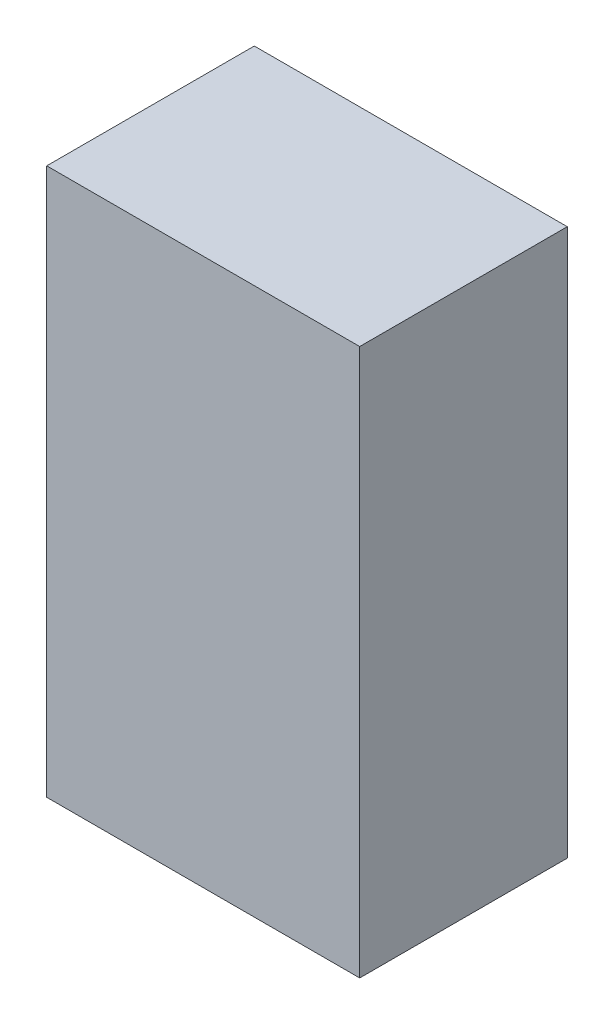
ISO-10303-21;
HEADER;
FILE_DESCRIPTION(('STEP AP214'),'2;1');
FILE_NAME('part.step','',(''),(''),'','','');
FILE_SCHEMA(('AUTOMOTIVE_DESIGN { 1 0 10303 214 1 1 1 1 }'));
ENDSEC;
DATA;
#1=APPLICATION_CONTEXT('core data for automotive mechanical design processes');
#2=APPLICATION_PROTOCOL_DEFINITION('international standard','automotive_design',2000,#1);
#3=PRODUCT_CONTEXT('',#1,'mechanical');
#4=PRODUCT('Part','Part','',(#3));
#5=PRODUCT_RELATED_PRODUCT_CATEGORY('part','',(#4));
#6=PRODUCT_DEFINITION_FORMATION('','',#4);
#7=PRODUCT_DEFINITION_CONTEXT('part definition',#1,'design');
#8=PRODUCT_DEFINITION('design','',#6,#7);
#9=PRODUCT_DEFINITION_SHAPE('','',#8);
#10=(LENGTH_UNIT() NAMED_UNIT(*) SI_UNIT(.MILLI.,.METRE.));
#11=(NAMED_UNIT(*) PLANE_ANGLE_UNIT() SI_UNIT($,.RADIAN.));
#12=(NAMED_UNIT(*) SI_UNIT($,.STERADIAN.) SOLID_ANGLE_UNIT());
#13=UNCERTAINTY_MEASURE_WITH_UNIT(LENGTH_MEASURE(1.E-05),#10,'distance_accuracy_value','');
#14=(GEOMETRIC_REPRESENTATION_CONTEXT(3) GLOBAL_UNCERTAINTY_ASSIGNED_CONTEXT((#13)) GLOBAL_UNIT_ASSIGNED_CONTEXT((#10,
#11,#12)) REPRESENTATION_CONTEXT('',''));
#15=CARTESIAN_POINT('',(0.,0.,0.));
#16=DIRECTION('',(0.,0.,1.));
#17=DIRECTION('',(1.,0.,0.));
#18=AXIS2_PLACEMENT_3D('',#15,#16,#17);
#19=CARTESIAN_POINT('',(-47.5,166.,-31.5));
#20=DIRECTION('',(1.,0.,0.));
#21=DIRECTION('',(0.,0.,-1.));
#22=AXIS2_PLACEMENT_3D('',#19,#20,#21);
#23=PLANE('',#22);
#24=DIRECTION('',(0.,0.,1.));
#25=VECTOR('',#24,1.);
#26=CARTESIAN_POINT('',(-47.5,0.,-31.5));
#27=LINE('',#26,#25);
#28=CARTESIAN_POINT('',(-47.5,0.,-31.5));
#29=VERTEX_POINT('',#28);
#30=CARTESIAN_POINT('',(-47.5,0.,31.5));
#31=VERTEX_POINT('',#30);
#32=EDGE_CURVE('E83',#29,#31,#27,.T.);
#33=ORIENTED_EDGE('',*,*,#32,.T.);
#34=DIRECTION('',(0.,-1.,0.));
#35=VECTOR('',#34,1.);
#36=CARTESIAN_POINT('',(-47.5,166.,31.5));
#37=LINE('',#36,#35);
#38=CARTESIAN_POINT('',(-47.5,166.,31.5));
#39=VERTEX_POINT('',#38);
#40=EDGE_CURVE('E11',#39,#31,#37,.T.);
#41=ORIENTED_EDGE('',*,*,#40,.F.);
#42=DIRECTION('',(0.,0.,1.));
#43=VECTOR('',#42,1.);
#44=CARTESIAN_POINT('',(-47.5,166.,-31.5));
#45=LINE('',#44,#43);
#46=CARTESIAN_POINT('',(-47.5,166.,-31.5));
#47=VERTEX_POINT('',#46);
#48=EDGE_CURVE('E106',#47,#39,#45,.T.);
#49=ORIENTED_EDGE('',*,*,#48,.F.);
#50=DIRECTION('',(0.,-1.,0.));
#51=VECTOR('',#50,1.);
#52=CARTESIAN_POINT('',(-47.5,166.,-31.5));
#53=LINE('',#52,#51);
#54=EDGE_CURVE('E96',#47,#29,#53,.T.);
#55=ORIENTED_EDGE('',*,*,#54,.T.);
#56=EDGE_LOOP('',(#33,#41,#49,#55));
#57=FACE_BOUND('',#56,.T.);
#58=ADVANCED_FACE('F38',(#57),#23,.F.);
#59=CARTESIAN_POINT('',(-47.5,166.,31.5));
#60=DIRECTION('',(0.,0.,-1.));
#61=DIRECTION('',(-1.,0.,0.));
#62=AXIS2_PLACEMENT_3D('',#59,#60,#61);
#63=PLANE('',#62);
#64=DIRECTION('',(1.,0.,0.));
#65=VECTOR('',#64,1.);
#66=CARTESIAN_POINT('',(-47.5,0.,31.5));
#67=LINE('',#66,#65);
#68=CARTESIAN_POINT('',(47.5,0.,31.5));
#69=VERTEX_POINT('',#68);
#70=EDGE_CURVE('E79',#31,#69,#67,.T.);
#71=ORIENTED_EDGE('',*,*,#70,.T.);
#72=DIRECTION('',(0.,-1.,0.));
#73=VECTOR('',#72,1.);
#74=CARTESIAN_POINT('',(47.5,166.,31.5));
#75=LINE('',#74,#73);
#76=CARTESIAN_POINT('',(47.5,166.,31.5));
#77=VERTEX_POINT('',#76);
#78=EDGE_CURVE('E46',#77,#69,#75,.T.);
#79=ORIENTED_EDGE('',*,*,#78,.F.);
#80=DIRECTION('',(1.,0.,0.));
#81=VECTOR('',#80,1.);
#82=CARTESIAN_POINT('',(-47.5,166.,31.5));
#83=LINE('',#82,#81);
#84=EDGE_CURVE('E92',#39,#77,#83,.T.);
#85=ORIENTED_EDGE('',*,*,#84,.F.);
#86=ORIENTED_EDGE('',*,*,#40,.T.);
#87=EDGE_LOOP('',(#71,#79,#85,#86));
#88=FACE_BOUND('',#87,.T.);
#89=ADVANCED_FACE('F91',(#88),#63,.F.);
#90=CARTESIAN_POINT('',(47.5,166.,-31.5));
#91=DIRECTION('',(-1.,0.,0.));
#92=DIRECTION('',(0.,0.,1.));
#93=AXIS2_PLACEMENT_3D('',#90,#91,#92);
#94=PLANE('',#93);
#95=DIRECTION('',(0.,0.,-1.));
#96=VECTOR('',#95,1.);
#97=CARTESIAN_POINT('',(47.5,0.,-31.5));
#98=LINE('',#97,#96);
#99=CARTESIAN_POINT('',(47.5,0.,-31.5));
#100=VERTEX_POINT('',#99);
#101=EDGE_CURVE('E84',#69,#100,#98,.T.);
#102=ORIENTED_EDGE('',*,*,#101,.T.);
#103=DIRECTION('',(0.,-1.,0.));
#104=VECTOR('',#103,1.);
#105=CARTESIAN_POINT('',(47.5,166.,-31.5));
#106=LINE('',#105,#104);
#107=CARTESIAN_POINT('',(47.5,166.,-31.5));
#108=VERTEX_POINT('',#107);
#109=EDGE_CURVE('E116',#108,#100,#106,.T.);
#110=ORIENTED_EDGE('',*,*,#109,.F.);
#111=DIRECTION('',(0.,0.,-1.));
#112=VECTOR('',#111,1.);
#113=CARTESIAN_POINT('',(47.5,166.,-31.5));
#114=LINE('',#113,#112);
#115=EDGE_CURVE('E58',#77,#108,#114,.T.);
#116=ORIENTED_EDGE('',*,*,#115,.F.);
#117=ORIENTED_EDGE('',*,*,#78,.T.);
#118=EDGE_LOOP('',(#102,#110,#116,#117));
#119=FACE_BOUND('',#118,.T.);
#120=ADVANCED_FACE('F121',(#119),#94,.F.);
#121=CARTESIAN_POINT('',(-47.5,166.,-31.5));
#122=DIRECTION('',(0.,0.,1.));
#123=DIRECTION('',(1.,0.,0.));
#124=AXIS2_PLACEMENT_3D('',#121,#122,#123);
#125=PLANE('',#124);
#126=DIRECTION('',(-1.,0.,0.));
#127=VECTOR('',#126,1.);
#128=CARTESIAN_POINT('',(-47.5,0.,-31.5));
#129=LINE('',#128,#127);
#130=EDGE_CURVE('E103',#100,#29,#129,.T.);
#131=ORIENTED_EDGE('',*,*,#130,.T.);
#132=ORIENTED_EDGE('',*,*,#54,.F.);
#133=DIRECTION('',(-1.,0.,0.));
#134=VECTOR('',#133,1.);
#135=CARTESIAN_POINT('',(-47.5,166.,-31.5));
#136=LINE('',#135,#134);
#137=EDGE_CURVE('E53',#108,#47,#136,.T.);
#138=ORIENTED_EDGE('',*,*,#137,.F.);
#139=ORIENTED_EDGE('',*,*,#109,.T.);
#140=EDGE_LOOP('',(#131,#132,#138,#139));
#141=FACE_BOUND('',#140,.T.);
#142=ADVANCED_FACE('F123',(#141),#125,.F.);
#143=CARTESIAN_POINT('',(-47.5,166.,31.5));
#144=DIRECTION('',(0.,1.,0.));
#145=DIRECTION('',(0.,0.,1.));
#146=AXIS2_PLACEMENT_3D('',#143,#144,#145);
#147=PLANE('',#146);
#148=ORIENTED_EDGE('',*,*,#48,.T.);
#149=ORIENTED_EDGE('',*,*,#84,.T.);
#150=ORIENTED_EDGE('',*,*,#115,.T.);
#151=ORIENTED_EDGE('',*,*,#137,.T.);
#152=EDGE_LOOP('',(#148,#149,#150,#151));
#153=FACE_BOUND('',#152,.T.);
#154=ADVANCED_FACE('F124',(#153),#147,.T.);
#155=CARTESIAN_POINT('',(-47.5,0.,31.5));
#156=DIRECTION('',(0.,1.,0.));
#157=DIRECTION('',(0.,0.,1.));
#158=AXIS2_PLACEMENT_3D('',#155,#156,#157);
#159=PLANE('',#158);
#160=ORIENTED_EDGE('',*,*,#32,.F.);
#161=ORIENTED_EDGE('',*,*,#130,.F.);
#162=ORIENTED_EDGE('',*,*,#101,.F.);
#163=ORIENTED_EDGE('',*,*,#70,.F.);
#164=EDGE_LOOP('',(#160,#161,#162,#163));
#165=FACE_BOUND('',#164,.T.);
#166=ADVANCED_FACE('F80',(#165),#159,.F.);
#167=CLOSED_SHELL('',(#58,#89,#120,#142,#154,#166));
#168=MANIFOLD_SOLID_BREP('B2',#167);
#169=ADVANCED_BREP_SHAPE_REPRESENTATION('',(#18,#168),#14);
#170=SHAPE_DEFINITION_REPRESENTATION(#9,#169);
ENDSEC;
END-ISO-10303-21;
